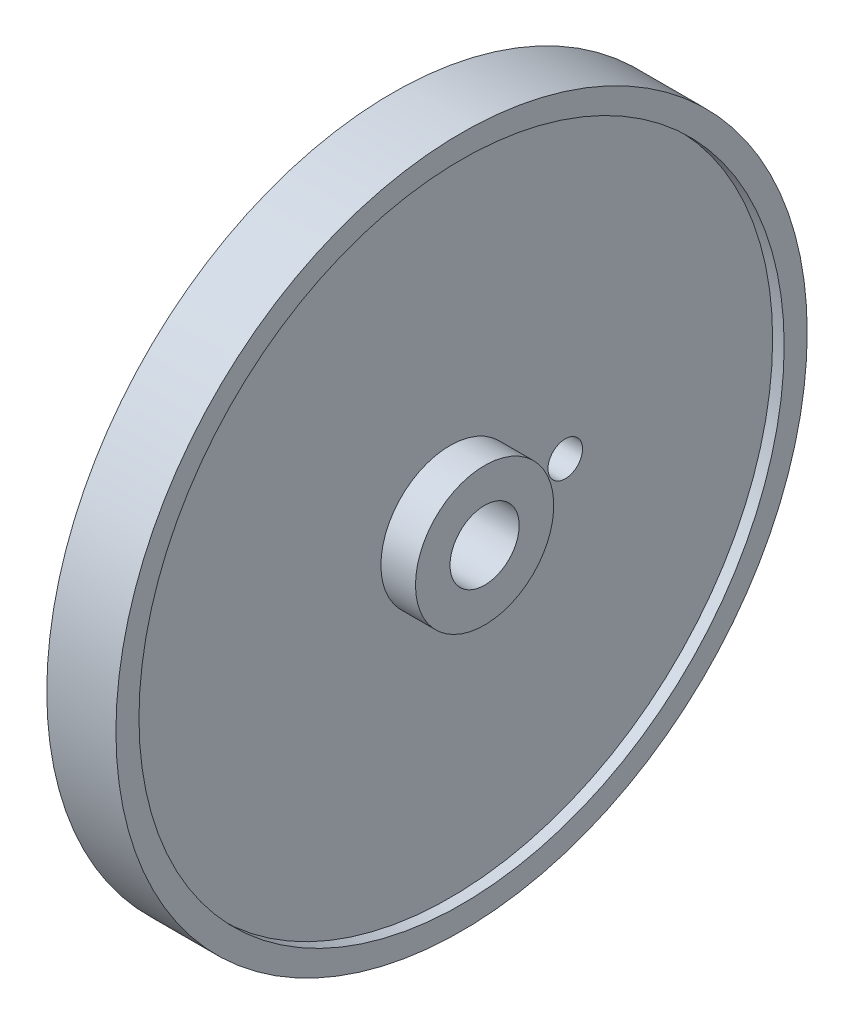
ISO-10303-21;
HEADER;
FILE_DESCRIPTION(('STEP AP214'),'2;1');
FILE_NAME('part.step','',(''),(''),'','','');
FILE_SCHEMA(('AUTOMOTIVE_DESIGN { 1 0 10303 214 1 1 1 1 }'));
ENDSEC;
DATA;
#1=APPLICATION_CONTEXT('core data for automotive mechanical design processes');
#2=APPLICATION_PROTOCOL_DEFINITION('international standard','automotive_design',2000,#1);
#3=PRODUCT_CONTEXT('',#1,'mechanical');
#4=PRODUCT('Part','Part','',(#3));
#5=PRODUCT_RELATED_PRODUCT_CATEGORY('part','',(#4));
#6=PRODUCT_DEFINITION_FORMATION('','',#4);
#7=PRODUCT_DEFINITION_CONTEXT('part definition',#1,'design');
#8=PRODUCT_DEFINITION('design','',#6,#7);
#9=PRODUCT_DEFINITION_SHAPE('','',#8);
#10=(LENGTH_UNIT() NAMED_UNIT(*) SI_UNIT(.MILLI.,.METRE.));
#11=(NAMED_UNIT(*) PLANE_ANGLE_UNIT() SI_UNIT($,.RADIAN.));
#12=(NAMED_UNIT(*) SI_UNIT($,.STERADIAN.) SOLID_ANGLE_UNIT());
#13=UNCERTAINTY_MEASURE_WITH_UNIT(LENGTH_MEASURE(1.E-05),#10,'distance_accuracy_value','');
#14=(GEOMETRIC_REPRESENTATION_CONTEXT(3) GLOBAL_UNCERTAINTY_ASSIGNED_CONTEXT((#13)) GLOBAL_UNIT_ASSIGNED_CONTEXT((#10,
#11,#12)) REPRESENTATION_CONTEXT('',''));
#15=CARTESIAN_POINT('',(0.,0.,0.));
#16=DIRECTION('',(0.,0.,1.));
#17=DIRECTION('',(1.,0.,0.));
#18=AXIS2_PLACEMENT_3D('',#15,#16,#17);
#19=CARTESIAN_POINT('',(5.,3.,0.));
#20=DIRECTION('',(-1.,0.,0.));
#21=DIRECTION('',(0.,0.,1.));
#22=AXIS2_PLACEMENT_3D('',#19,#20,#21);
#23=PLANE('',#22);
#24=CARTESIAN_POINT('',(5.,0.,0.));
#25=DIRECTION('',(-1.,0.,0.));
#26=DIRECTION('',(0.,0.,1.));
#27=AXIS2_PLACEMENT_3D('',#24,#25,#26);
#28=CIRCLE('',#27,6.00000000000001);
#29=CARTESIAN_POINT('',(5.,0.,6.00000000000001));
#30=VERTEX_POINT('',#29);
#31=EDGE_CURVE('E10',#30,#30,#28,.T.);
#32=ORIENTED_EDGE('',*,*,#31,.F.);
#33=EDGE_LOOP('',(#32));
#34=FACE_BOUND('',#33,.T.);
#35=CARTESIAN_POINT('',(5.,0.,0.));
#36=DIRECTION('',(-1.,0.,0.));
#37=DIRECTION('',(0.,0.,1.));
#38=AXIS2_PLACEMENT_3D('',#35,#36,#37);
#39=CIRCLE('',#38,3.);
#40=CARTESIAN_POINT('',(5.,0.,3.));
#41=VERTEX_POINT('',#40);
#42=EDGE_CURVE('E69',#41,#41,#39,.T.);
#43=ORIENTED_EDGE('',*,*,#42,.T.);
#44=EDGE_LOOP('',(#43));
#45=FACE_BOUND('',#44,.T.);
#46=ADVANCED_FACE('F29',(#34,#45),#23,.F.);
#47=CARTESIAN_POINT('',(-5.7575463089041,0.,0.));
#48=DIRECTION('',(-1.,0.,0.));
#49=DIRECTION('',(0.,0.,1.));
#50=AXIS2_PLACEMENT_3D('',#47,#48,#49);
#51=CYLINDRICAL_SURFACE('',#50,6.);
#52=CARTESIAN_POINT('',(2.,0.,0.));
#53=DIRECTION('',(-1.,0.,0.));
#54=DIRECTION('',(0.,0.,1.));
#55=AXIS2_PLACEMENT_3D('',#52,#53,#54);
#56=CIRCLE('',#55,6.);
#57=CARTESIAN_POINT('',(2.,0.,6.));
#58=VERTEX_POINT('',#57);
#59=EDGE_CURVE('E36',#58,#58,#56,.T.);
#60=ORIENTED_EDGE('',*,*,#59,.F.);
#61=EDGE_LOOP('',(#60));
#62=FACE_BOUND('',#61,.T.);
#63=ORIENTED_EDGE('',*,*,#31,.T.);
#64=EDGE_LOOP('',(#63));
#65=FACE_BOUND('',#64,.T.);
#66=ADVANCED_FACE('F93',(#62,#65),#51,.T.);
#67=CARTESIAN_POINT('',(2.,6.,0.));
#68=DIRECTION('',(-1.,0.,0.));
#69=DIRECTION('',(0.,0.,1.));
#70=AXIS2_PLACEMENT_3D('',#67,#68,#69);
#71=PLANE('',#70);
#72=CARTESIAN_POINT('',(2.,0.,-10.));
#73=DIRECTION('',(1.,0.,0.));
#74=DIRECTION('',(0.,0.,-1.));
#75=AXIS2_PLACEMENT_3D('',#72,#73,#74);
#76=CIRCLE('',#75,1.5);
#77=CARTESIAN_POINT('',(2.,0.,-11.5));
#78=VERTEX_POINT('',#77);
#79=EDGE_CURVE('E72',#78,#78,#76,.T.);
#80=ORIENTED_EDGE('',*,*,#79,.F.);
#81=EDGE_LOOP('',(#80));
#82=FACE_BOUND('',#81,.T.);
#83=CARTESIAN_POINT('',(2.,0.,0.));
#84=DIRECTION('',(-1.,0.,0.));
#85=DIRECTION('',(0.,0.,1.));
#86=AXIS2_PLACEMENT_3D('',#83,#84,#85);
#87=CIRCLE('',#86,28.);
#88=CARTESIAN_POINT('',(2.,0.,28.));
#89=VERTEX_POINT('',#88);
#90=EDGE_CURVE('E40',#89,#89,#87,.T.);
#91=ORIENTED_EDGE('',*,*,#90,.F.);
#92=EDGE_LOOP('',(#91));
#93=FACE_BOUND('',#92,.T.);
#94=ORIENTED_EDGE('',*,*,#59,.T.);
#95=EDGE_LOOP('',(#94));
#96=FACE_BOUND('',#95,.T.);
#97=ADVANCED_FACE('F98',(#82,#93,#96),#71,.F.);
#98=CARTESIAN_POINT('',(-5.7575463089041,0.,0.));
#99=DIRECTION('',(-1.,0.,0.));
#100=DIRECTION('',(0.,0.,1.));
#101=AXIS2_PLACEMENT_3D('',#98,#99,#100);
#102=CYLINDRICAL_SURFACE('',#101,28.);
#103=CARTESIAN_POINT('',(3.,0.,0.));
#104=DIRECTION('',(-1.,0.,0.));
#105=DIRECTION('',(0.,0.,1.));
#106=AXIS2_PLACEMENT_3D('',#103,#104,#105);
#107=CIRCLE('',#106,28.);
#108=CARTESIAN_POINT('',(3.,0.,28.));
#109=VERTEX_POINT('',#108);
#110=EDGE_CURVE('E45',#109,#109,#107,.T.);
#111=ORIENTED_EDGE('',*,*,#110,.F.);
#112=EDGE_LOOP('',(#111));
#113=FACE_BOUND('',#112,.T.);
#114=ORIENTED_EDGE('',*,*,#90,.T.);
#115=EDGE_LOOP('',(#114));
#116=FACE_BOUND('',#115,.T.);
#117=ADVANCED_FACE('F141',(#113,#116),#102,.F.);
#118=CARTESIAN_POINT('',(3.,28.,0.));
#119=DIRECTION('',(-1.,0.,0.));
#120=DIRECTION('',(0.,0.,1.));
#121=AXIS2_PLACEMENT_3D('',#118,#119,#120);
#122=PLANE('',#121);
#123=CARTESIAN_POINT('',(3.,0.,0.));
#124=DIRECTION('',(-1.,0.,0.));
#125=DIRECTION('',(0.,0.,1.));
#126=AXIS2_PLACEMENT_3D('',#123,#124,#125);
#127=CIRCLE('',#126,30.);
#128=CARTESIAN_POINT('',(3.,0.,30.));
#129=VERTEX_POINT('',#128);
#130=EDGE_CURVE('E48',#129,#129,#127,.T.);
#131=ORIENTED_EDGE('',*,*,#130,.F.);
#132=EDGE_LOOP('',(#131));
#133=FACE_BOUND('',#132,.T.);
#134=ORIENTED_EDGE('',*,*,#110,.T.);
#135=EDGE_LOOP('',(#134));
#136=FACE_BOUND('',#135,.T.);
#137=ADVANCED_FACE('F135',(#133,#136),#122,.F.);
#138=CARTESIAN_POINT('',(-5.7575463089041,0.,0.));
#139=DIRECTION('',(-1.,0.,0.));
#140=DIRECTION('',(0.,0.,1.));
#141=AXIS2_PLACEMENT_3D('',#138,#139,#140);
#142=CYLINDRICAL_SURFACE('',#141,30.);
#143=CARTESIAN_POINT('',(-3.,0.,0.));
#144=DIRECTION('',(-1.,0.,0.));
#145=DIRECTION('',(0.,0.,1.));
#146=AXIS2_PLACEMENT_3D('',#143,#144,#145);
#147=CIRCLE('',#146,30.);
#148=CARTESIAN_POINT('',(-3.,0.,30.));
#149=VERTEX_POINT('',#148);
#150=EDGE_CURVE('E51',#149,#149,#147,.T.);
#151=ORIENTED_EDGE('',*,*,#150,.F.);
#152=EDGE_LOOP('',(#151));
#153=FACE_BOUND('',#152,.T.);
#154=ORIENTED_EDGE('',*,*,#130,.T.);
#155=EDGE_LOOP('',(#154));
#156=FACE_BOUND('',#155,.T.);
#157=ADVANCED_FACE('F129',(#153,#156),#142,.T.);
#158=CARTESIAN_POINT('',(-3.,28.,0.));
#159=DIRECTION('',(1.,0.,0.));
#160=DIRECTION('',(0.,0.,-1.));
#161=AXIS2_PLACEMENT_3D('',#158,#159,#160);
#162=PLANE('',#161);
#163=CARTESIAN_POINT('',(-3.,0.,0.));
#164=DIRECTION('',(-1.,0.,0.));
#165=DIRECTION('',(0.,0.,1.));
#166=AXIS2_PLACEMENT_3D('',#163,#164,#165);
#167=CIRCLE('',#166,28.);
#168=CARTESIAN_POINT('',(-3.,0.,28.));
#169=VERTEX_POINT('',#168);
#170=EDGE_CURVE('E54',#169,#169,#167,.T.);
#171=ORIENTED_EDGE('',*,*,#170,.F.);
#172=EDGE_LOOP('',(#171));
#173=FACE_BOUND('',#172,.T.);
#174=ORIENTED_EDGE('',*,*,#150,.T.);
#175=EDGE_LOOP('',(#174));
#176=FACE_BOUND('',#175,.T.);
#177=ADVANCED_FACE('F123',(#173,#176),#162,.F.);
#178=CARTESIAN_POINT('',(-5.7575463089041,0.,0.));
#179=DIRECTION('',(-1.,0.,0.));
#180=DIRECTION('',(0.,0.,1.));
#181=AXIS2_PLACEMENT_3D('',#178,#179,#180);
#182=CYLINDRICAL_SURFACE('',#181,28.);
#183=CARTESIAN_POINT('',(-2.,0.,0.));
#184=DIRECTION('',(-1.,0.,0.));
#185=DIRECTION('',(0.,0.,1.));
#186=AXIS2_PLACEMENT_3D('',#183,#184,#185);
#187=CIRCLE('',#186,28.);
#188=CARTESIAN_POINT('',(-2.,0.,28.));
#189=VERTEX_POINT('',#188);
#190=EDGE_CURVE('E57',#189,#189,#187,.T.);
#191=ORIENTED_EDGE('',*,*,#190,.F.);
#192=EDGE_LOOP('',(#191));
#193=FACE_BOUND('',#192,.T.);
#194=ORIENTED_EDGE('',*,*,#170,.T.);
#195=EDGE_LOOP('',(#194));
#196=FACE_BOUND('',#195,.T.);
#197=ADVANCED_FACE('F117',(#193,#196),#182,.F.);
#198=CARTESIAN_POINT('',(-2.,6.,0.));
#199=DIRECTION('',(1.,0.,0.));
#200=DIRECTION('',(0.,0.,-1.));
#201=AXIS2_PLACEMENT_3D('',#198,#199,#200);
#202=PLANE('',#201);
#203=CARTESIAN_POINT('',(-2.,0.,-10.));
#204=DIRECTION('',(1.,0.,0.));
#205=DIRECTION('',(0.,0.,-1.));
#206=AXIS2_PLACEMENT_3D('',#203,#204,#205);
#207=CIRCLE('',#206,1.5);
#208=CARTESIAN_POINT('',(-2.,0.,-11.5));
#209=VERTEX_POINT('',#208);
#210=EDGE_CURVE('E32',#209,#209,#207,.T.);
#211=ORIENTED_EDGE('',*,*,#210,.T.);
#212=EDGE_LOOP('',(#211));
#213=FACE_BOUND('',#212,.T.);
#214=CARTESIAN_POINT('',(-2.,0.,0.));
#215=DIRECTION('',(-1.,0.,0.));
#216=DIRECTION('',(0.,0.,1.));
#217=AXIS2_PLACEMENT_3D('',#214,#215,#216);
#218=CIRCLE('',#217,6.);
#219=CARTESIAN_POINT('',(-2.,0.,6.));
#220=VERTEX_POINT('',#219);
#221=EDGE_CURVE('E60',#220,#220,#218,.T.);
#222=ORIENTED_EDGE('',*,*,#221,.F.);
#223=EDGE_LOOP('',(#222));
#224=FACE_BOUND('',#223,.T.);
#225=ORIENTED_EDGE('',*,*,#190,.T.);
#226=EDGE_LOOP('',(#225));
#227=FACE_BOUND('',#226,.T.);
#228=ADVANCED_FACE('F79',(#213,#224,#227),#202,.F.);
#229=CARTESIAN_POINT('',(-5.7575463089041,0.,0.));
#230=DIRECTION('',(-1.,0.,0.));
#231=DIRECTION('',(0.,0.,1.));
#232=AXIS2_PLACEMENT_3D('',#229,#230,#231);
#233=CYLINDRICAL_SURFACE('',#232,6.);
#234=CARTESIAN_POINT('',(-5.,0.,0.));
#235=DIRECTION('',(-1.,0.,0.));
#236=DIRECTION('',(0.,0.,1.));
#237=AXIS2_PLACEMENT_3D('',#234,#235,#236);
#238=CIRCLE('',#237,6.00000000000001);
#239=CARTESIAN_POINT('',(-5.,0.,6.00000000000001));
#240=VERTEX_POINT('',#239);
#241=EDGE_CURVE('E63',#240,#240,#238,.T.);
#242=ORIENTED_EDGE('',*,*,#241,.F.);
#243=EDGE_LOOP('',(#242));
#244=FACE_BOUND('',#243,.T.);
#245=ORIENTED_EDGE('',*,*,#221,.T.);
#246=EDGE_LOOP('',(#245));
#247=FACE_BOUND('',#246,.T.);
#248=ADVANCED_FACE('F107',(#244,#247),#233,.T.);
#249=CARTESIAN_POINT('',(-5.,3.,0.));
#250=DIRECTION('',(1.,0.,0.));
#251=DIRECTION('',(0.,0.,-1.));
#252=AXIS2_PLACEMENT_3D('',#249,#250,#251);
#253=PLANE('',#252);
#254=CARTESIAN_POINT('',(-5.,0.,0.));
#255=DIRECTION('',(-1.,0.,0.));
#256=DIRECTION('',(0.,0.,1.));
#257=AXIS2_PLACEMENT_3D('',#254,#255,#256);
#258=CIRCLE('',#257,3.);
#259=CARTESIAN_POINT('',(-5.,0.,3.));
#260=VERTEX_POINT('',#259);
#261=EDGE_CURVE('E66',#260,#260,#258,.T.);
#262=ORIENTED_EDGE('',*,*,#261,.F.);
#263=EDGE_LOOP('',(#262));
#264=FACE_BOUND('',#263,.T.);
#265=ORIENTED_EDGE('',*,*,#241,.T.);
#266=EDGE_LOOP('',(#265));
#267=FACE_BOUND('',#266,.T.);
#268=ADVANCED_FACE('F89',(#264,#267),#253,.F.);
#269=CARTESIAN_POINT('',(-5.7575463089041,0.,0.));
#270=DIRECTION('',(-1.,0.,0.));
#271=DIRECTION('',(0.,0.,1.));
#272=AXIS2_PLACEMENT_3D('',#269,#270,#271);
#273=CYLINDRICAL_SURFACE('',#272,3.);
#274=ORIENTED_EDGE('',*,*,#42,.F.);
#275=EDGE_LOOP('',(#274));
#276=FACE_BOUND('',#275,.T.);
#277=ORIENTED_EDGE('',*,*,#261,.T.);
#278=EDGE_LOOP('',(#277));
#279=FACE_BOUND('',#278,.T.);
#280=ADVANCED_FACE('F84',(#276,#279),#273,.F.);
#281=CARTESIAN_POINT('',(-8.,0.,-10.));
#282=DIRECTION('',(1.,0.,0.));
#283=DIRECTION('',(0.,0.,-1.));
#284=AXIS2_PLACEMENT_3D('',#281,#282,#283);
#285=CYLINDRICAL_SURFACE('',#284,1.5);
#286=ORIENTED_EDGE('',*,*,#79,.T.);
#287=EDGE_LOOP('',(#286));
#288=FACE_BOUND('',#287,.T.);
#289=ORIENTED_EDGE('',*,*,#210,.F.);
#290=EDGE_LOOP('',(#289));
#291=FACE_BOUND('',#290,.T.);
#292=ADVANCED_FACE('F82',(#288,#291),#285,.F.);
#293=CLOSED_SHELL('',(#46,#66,#97,#117,#137,#157,#177,#197,#228,#248,#268,#280,#292));
#294=MANIFOLD_SOLID_BREP('B2',#293);
#295=ADVANCED_BREP_SHAPE_REPRESENTATION('',(#18,#294),#14);
#296=SHAPE_DEFINITION_REPRESENTATION(#9,#295);
ENDSEC;
END-ISO-10303-21;
